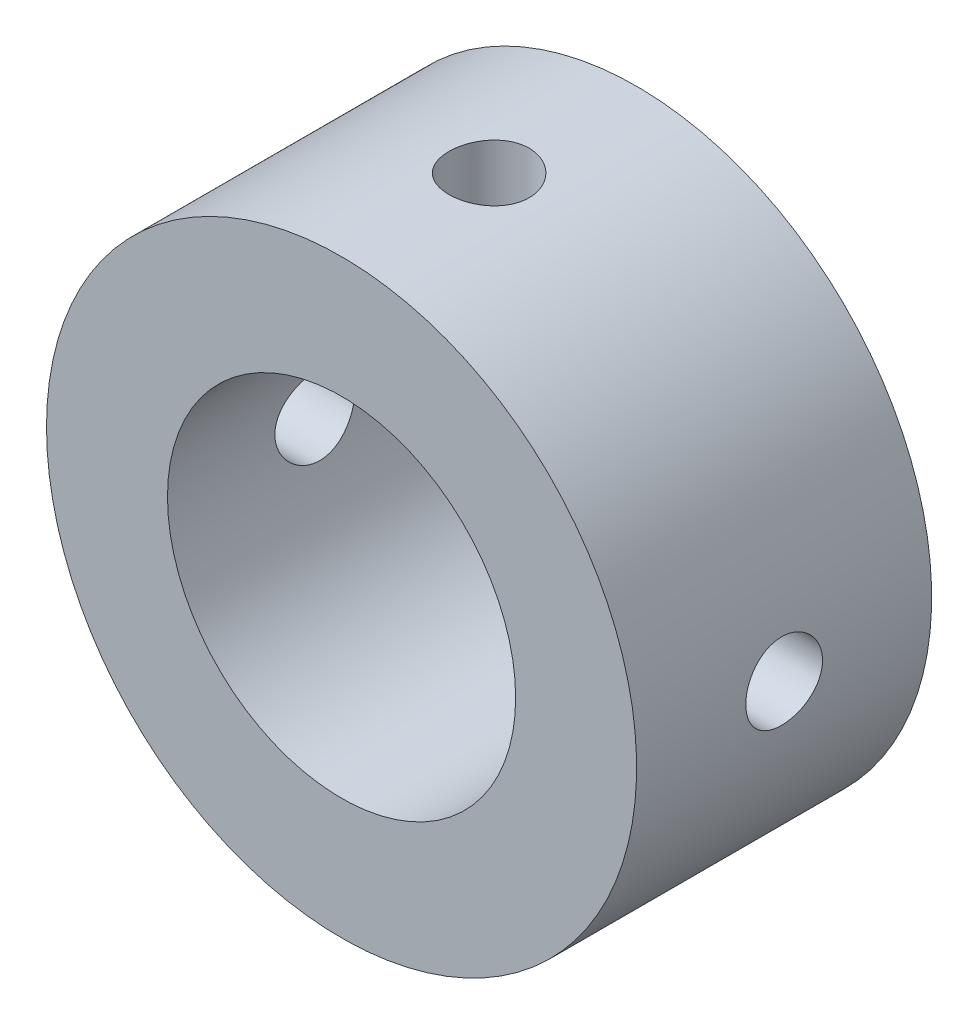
ISO-10303-21;
HEADER;
FILE_DESCRIPTION(('STEP AP214'),'2;1');
FILE_NAME('part.step','',(''),(''),'','','');
FILE_SCHEMA(('AUTOMOTIVE_DESIGN { 1 0 10303 214 1 1 1 1 }'));
ENDSEC;
DATA;
#1=APPLICATION_CONTEXT('core data for automotive mechanical design processes');
#2=APPLICATION_PROTOCOL_DEFINITION('international standard','automotive_design',2000,#1);
#3=PRODUCT_CONTEXT('',#1,'mechanical');
#4=PRODUCT('Part','Part','',(#3));
#5=PRODUCT_RELATED_PRODUCT_CATEGORY('part','',(#4));
#6=PRODUCT_DEFINITION_FORMATION('','',#4);
#7=PRODUCT_DEFINITION_CONTEXT('part definition',#1,'design');
#8=PRODUCT_DEFINITION('design','',#6,#7);
#9=PRODUCT_DEFINITION_SHAPE('','',#8);
#10=(LENGTH_UNIT() NAMED_UNIT(*) SI_UNIT(.MILLI.,.METRE.));
#11=(NAMED_UNIT(*) PLANE_ANGLE_UNIT() SI_UNIT($,.RADIAN.));
#12=(NAMED_UNIT(*) SI_UNIT($,.STERADIAN.) SOLID_ANGLE_UNIT());
#13=UNCERTAINTY_MEASURE_WITH_UNIT(LENGTH_MEASURE(1.E-05),#10,'distance_accuracy_value','');
#14=(GEOMETRIC_REPRESENTATION_CONTEXT(3) GLOBAL_UNCERTAINTY_ASSIGNED_CONTEXT((#13)) GLOBAL_UNIT_ASSIGNED_CONTEXT((#10,
#11,#12)) REPRESENTATION_CONTEXT('',''));
#15=CARTESIAN_POINT('',(0.,0.,0.));
#16=DIRECTION('',(0.,0.,1.));
#17=DIRECTION('',(1.,0.,0.));
#18=AXIS2_PLACEMENT_3D('',#15,#16,#17);
#19=CARTESIAN_POINT('',(0.,0.,12.7));
#20=DIRECTION('',(0.,0.,-1.));
#21=DIRECTION('',(-1.,0.,0.));
#22=AXIS2_PLACEMENT_3D('',#19,#20,#21);
#23=PLANE('',#22);
#24=CARTESIAN_POINT('',(0.,0.,12.7));
#25=DIRECTION('',(0.,0.,-1.));
#26=DIRECTION('',(-1.,0.,0.));
#27=AXIS2_PLACEMENT_3D('',#24,#25,#26);
#28=CIRCLE('',#27,7.493);
#29=CARTESIAN_POINT('',(-7.493,0.,12.7));
#30=VERTEX_POINT('',#29);
#31=EDGE_CURVE('E179',#30,#30,#28,.T.);
#32=ORIENTED_EDGE('',*,*,#31,.T.);
#33=EDGE_LOOP('',(#32));
#34=FACE_BOUND('',#33,.T.);
#35=CARTESIAN_POINT('',(0.,0.,12.7));
#36=DIRECTION('',(0.,0.,-1.));
#37=DIRECTION('',(-1.,0.,0.));
#38=AXIS2_PLACEMENT_3D('',#35,#36,#37);
#39=CIRCLE('',#38,12.7);
#40=CARTESIAN_POINT('',(-12.7,0.,12.7));
#41=VERTEX_POINT('',#40);
#42=EDGE_CURVE('E203',#41,#41,#39,.T.);
#43=ORIENTED_EDGE('',*,*,#42,.F.);
#44=EDGE_LOOP('',(#43));
#45=FACE_BOUND('',#44,.T.);
#46=ADVANCED_FACE('F125',(#34,#45),#23,.F.);
#47=CARTESIAN_POINT('',(0.,0.,0.));
#48=DIRECTION('',(0.,0.,-1.));
#49=DIRECTION('',(-1.,0.,0.));
#50=AXIS2_PLACEMENT_3D('',#47,#48,#49);
#51=PLANE('',#50);
#52=CARTESIAN_POINT('',(0.,0.,0.));
#53=DIRECTION('',(0.,0.,-1.));
#54=DIRECTION('',(-1.,0.,0.));
#55=AXIS2_PLACEMENT_3D('',#52,#53,#54);
#56=CIRCLE('',#55,7.493);
#57=CARTESIAN_POINT('',(-7.493,0.,0.));
#58=VERTEX_POINT('',#57);
#59=EDGE_CURVE('E180',#58,#58,#56,.T.);
#60=ORIENTED_EDGE('',*,*,#59,.F.);
#61=EDGE_LOOP('',(#60));
#62=FACE_BOUND('',#61,.T.);
#63=CARTESIAN_POINT('',(0.,0.,0.));
#64=DIRECTION('',(0.,0.,-1.));
#65=DIRECTION('',(-1.,0.,0.));
#66=AXIS2_PLACEMENT_3D('',#63,#64,#65);
#67=CIRCLE('',#66,12.7);
#68=CARTESIAN_POINT('',(-12.7,0.,0.));
#69=VERTEX_POINT('',#68);
#70=EDGE_CURVE('E205',#69,#69,#67,.T.);
#71=ORIENTED_EDGE('',*,*,#70,.T.);
#72=EDGE_LOOP('',(#71));
#73=FACE_BOUND('',#72,.T.);
#74=ADVANCED_FACE('F127',(#62,#73),#51,.T.);
#75=CARTESIAN_POINT('',(12.7,0.,6.35));
#76=DIRECTION('',(1.,0.,0.));
#77=DIRECTION('',(0.,0.,-1.));
#78=AXIS2_PLACEMENT_3D('',#75,#76,#77);
#79=CYLINDRICAL_SURFACE('',#78,1.65);
#80=CARTESIAN_POINT('',(7.493,0.,4.7));
#81=CARTESIAN_POINT('',(7.4929983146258,-0.0914977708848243,4.70000310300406));
#82=CARTESIAN_POINT('',(7.49130705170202,-0.183032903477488,4.70763645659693));
#83=CARTESIAN_POINT('',(7.48472364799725,-0.363502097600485,4.73793586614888));
#84=CARTESIAN_POINT('',(7.47982924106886,-0.452434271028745,4.76061256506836));
#85=CARTESIAN_POINT('',(7.46738437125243,-0.625063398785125,4.82025313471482));
#86=CARTESIAN_POINT('',(7.45983670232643,-0.708765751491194,4.85720198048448));
#87=CARTESIAN_POINT('',(7.44289943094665,-0.868780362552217,4.94429008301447));
#88=CARTESIAN_POINT('',(7.43350987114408,-0.945092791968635,4.99442903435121));
#89=CARTESIAN_POINT('',(7.41374640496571,-1.08940429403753,5.10733630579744));
#90=CARTESIAN_POINT('',(7.40336015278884,-1.15726608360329,5.17027794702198));
#91=CARTESIAN_POINT('',(7.38286066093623,-1.28155946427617,5.3066318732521));
#92=CARTESIAN_POINT('',(7.37274744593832,-1.33799002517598,5.38004510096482));
#93=CARTESIAN_POINT('',(7.35381724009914,-1.43842656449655,5.53627556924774));
#94=CARTESIAN_POINT('',(7.34501606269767,-1.48228606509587,5.61918906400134));
#95=CARTESIAN_POINT('',(7.32988376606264,-1.55539578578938,5.79143551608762));
#96=CARTESIAN_POINT('',(7.32355234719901,-1.58464777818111,5.88076769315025));
#97=CARTESIAN_POINT('',(7.31420221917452,-1.62725776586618,6.06182556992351));
#98=CARTESIAN_POINT('',(7.31113287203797,-1.64085899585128,6.15349135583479));
#99=CARTESIAN_POINT('',(7.30850234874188,-1.65253773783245,6.33785113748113));
#100=CARTESIAN_POINT('',(7.30894073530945,-1.65061718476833,6.43054500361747));
#101=CARTESIAN_POINT('',(7.31323031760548,-1.63150254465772,6.61251900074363));
#102=CARTESIAN_POINT('',(7.31701830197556,-1.61459133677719,6.70183056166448));
#103=CARTESIAN_POINT('',(7.32748029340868,-1.56642373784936,6.876316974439));
#104=CARTESIAN_POINT('',(7.33415446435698,-1.53516653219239,6.96149159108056));
#105=CARTESIAN_POINT('',(7.34969891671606,-1.45893531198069,7.12607991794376));
#106=CARTESIAN_POINT('',(7.35858646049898,-1.41385280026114,7.20544167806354));
#107=CARTESIAN_POINT('',(7.37754570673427,-1.31132696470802,7.35557827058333));
#108=CARTESIAN_POINT('',(7.38761757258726,-1.25388193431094,7.42635191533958));
#109=CARTESIAN_POINT('',(7.40808160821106,-1.12676572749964,7.55893157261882));
#110=CARTESIAN_POINT('',(7.41847595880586,-1.05685408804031,7.62050692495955));
#111=CARTESIAN_POINT('',(7.43821275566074,-0.907578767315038,7.731097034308));
#112=CARTESIAN_POINT('',(7.44755518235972,-0.828214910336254,7.78011155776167));
#113=CARTESIAN_POINT('',(7.46416646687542,-0.66200435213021,7.86424687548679));
#114=CARTESIAN_POINT('',(7.47143075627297,-0.575141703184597,7.89933712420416));
#115=CARTESIAN_POINT('',(7.48303336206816,-0.396557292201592,7.95435928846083));
#116=CARTESIAN_POINT('',(7.48737210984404,-0.304836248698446,7.97429343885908));
#117=CARTESIAN_POINT('',(7.49257326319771,-0.121116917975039,7.99810131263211));
#118=CARTESIAN_POINT('',(7.49350385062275,-0.0291613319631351,8.00229007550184));
#119=CARTESIAN_POINT('',(7.49197503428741,0.154135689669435,7.99534262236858));
#120=CARTESIAN_POINT('',(7.48951586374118,0.245477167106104,7.98420746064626));
#121=CARTESIAN_POINT('',(7.48152690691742,0.423907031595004,7.94718941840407));
#122=CARTESIAN_POINT('',(7.47603160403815,0.511031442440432,7.92147207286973));
#123=CARTESIAN_POINT('',(7.46258559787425,0.679729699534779,7.85620365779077));
#124=CARTESIAN_POINT('',(7.45463468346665,0.761303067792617,7.81665139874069));
#125=CARTESIAN_POINT('',(7.43699140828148,0.917884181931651,7.72418155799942));
#126=CARTESIAN_POINT('',(7.42727556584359,0.992780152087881,7.67107928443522));
#127=CARTESIAN_POINT('',(7.40722756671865,1.13271104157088,7.55325967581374));
#128=CARTESIAN_POINT('',(7.39689532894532,1.19774465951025,7.48854081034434));
#129=CARTESIAN_POINT('',(7.37654309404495,1.31735270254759,7.34787865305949));
#130=CARTESIAN_POINT('',(7.36653254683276,1.37170883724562,7.27174812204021));
#131=CARTESIAN_POINT('',(7.34817751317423,1.46686542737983,7.111254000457));
#132=CARTESIAN_POINT('',(7.33983295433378,1.50766647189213,7.02689076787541));
#133=CARTESIAN_POINT('',(7.32583505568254,1.57427735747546,6.85277975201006));
#134=CARTESIAN_POINT('',(7.32016654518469,1.60017189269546,6.76306565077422));
#135=CARTESIAN_POINT('',(7.31213566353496,1.63648195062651,6.58041853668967));
#136=CARTESIAN_POINT('',(7.30977275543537,1.64689998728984,6.48748604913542));
#137=CARTESIAN_POINT('',(7.30865477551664,1.65185320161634,6.30324197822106));
#138=CARTESIAN_POINT('',(7.30982105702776,1.64673459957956,6.2119400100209));
#139=CARTESIAN_POINT('',(7.31545200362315,1.62153465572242,6.03153389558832));
#140=CARTESIAN_POINT('',(7.31991662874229,1.60145349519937,5.94242972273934));
#141=CARTESIAN_POINT('',(7.33160261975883,1.54706675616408,5.7692280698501));
#142=CARTESIAN_POINT('',(7.33881408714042,1.51281221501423,5.68511385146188));
#143=CARTESIAN_POINT('',(7.35518496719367,1.43109467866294,5.52377508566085));
#144=CARTESIAN_POINT('',(7.36434458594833,1.38363028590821,5.44655126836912));
#145=CARTESIAN_POINT('',(7.38381417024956,1.275694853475,5.2994801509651));
#146=CARTESIAN_POINT('',(7.39414385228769,1.21497735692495,5.22981630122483));
#147=CARTESIAN_POINT('',(7.41465788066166,1.08275788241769,5.10155270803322));
#148=CARTESIAN_POINT('',(7.42484219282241,1.01125341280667,5.04295552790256));
#149=CARTESIAN_POINT('',(7.44407733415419,0.8583532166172,4.93774813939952));
#150=CARTESIAN_POINT('',(7.45311144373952,0.776839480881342,4.89130620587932));
#151=CARTESIAN_POINT('',(7.46886021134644,0.606980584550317,4.81285634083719));
#152=CARTESIAN_POINT('',(7.47557680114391,0.518641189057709,4.78083638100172));
#153=CARTESIAN_POINT('',(7.48474434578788,0.358519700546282,4.73780422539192));
#154=CARTESIAN_POINT('',(7.48782094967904,0.287599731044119,4.72365484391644));
#155=CARTESIAN_POINT('',(7.4919493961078,0.144460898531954,4.70475171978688));
#156=CARTESIAN_POINT('',(7.49300133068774,0.0722420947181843,4.69999755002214));
#157=CARTESIAN_POINT('',(7.493,0.,4.7));
#158=B_SPLINE_CURVE_WITH_KNOTS('',3,(#80,#81,#82,#83,#84,#85,#86,#87,#88,#89,#90,#91,#92,#93,
#94,#95,#96,#97,#98,#99,#100,#101,#102,#103,#104,#105,#106,#107,#108,#109,#110,#111,#112,#113,
#114,#115,#116,#117,#118,#119,#120,#121,#122,#123,#124,#125,#126,#127,#128,#129,#130,#131,#132,
#133,#134,#135,#136,#137,#138,#139,#140,#141,#142,#143,#144,#145,#146,#147,#148,#149,#150,#151,
#152,#153,#154,#155,#156,#157),.UNSPECIFIED.,.T.,.F.,(4,2,2,2,2,2,2,2,2,2,2,2,2,2,2,2,2,2,2,2,2,
2,2,2,2,2,2,2,2,2,2,2,2,2,2,2,2,2,4),(0.,0.274228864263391,0.5486519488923,0.822786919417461,
1.09691554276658,1.37503711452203,1.65318374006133,1.93445056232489,2.21568325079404,
2.49248350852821,2.7692492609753,3.04090095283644,3.31256807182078,3.5864242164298,
3.86031818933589,4.14021782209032,4.42012265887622,4.70063817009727,4.98111230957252,
5.25594379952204,5.53075638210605,5.80251005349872,6.07428709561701,6.34998734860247,
6.62572395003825,6.90661601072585,7.18749586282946,7.46676367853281,7.74598612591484,
8.01903237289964,8.29207531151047,8.56414348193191,8.83624044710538,9.11390968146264,
9.39164315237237,9.67303935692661,9.9542004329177,10.1707277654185,10.38724525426),.UNSPECIFIED.);
#159=CARTESIAN_POINT('',(7.493,0.,4.7));
#160=VERTEX_POINT('',#159);
#161=EDGE_CURVE('E158',#160,#160,#158,.T.);
#162=ORIENTED_EDGE('',*,*,#161,.T.);
#163=EDGE_LOOP('',(#162));
#164=FACE_BOUND('',#163,.T.);
#165=CARTESIAN_POINT('',(12.7,0.,8.));
#166=CARTESIAN_POINT('',(12.699998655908,0.0921793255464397,7.99999591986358));
#167=CARTESIAN_POINT('',(12.6989850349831,0.184479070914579,7.99224320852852));
#168=CARTESIAN_POINT('',(12.6950367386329,0.36657291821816,7.96142269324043));
#169=CARTESIAN_POINT('',(12.6920980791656,0.456361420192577,7.93832312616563));
#170=CARTESIAN_POINT('',(12.6846305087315,0.630674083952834,7.8775000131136));
#171=CARTESIAN_POINT('',(12.6801033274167,0.71520385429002,7.83979236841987));
#172=CARTESIAN_POINT('',(12.6699627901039,0.876696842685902,7.75085672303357));
#173=CARTESIAN_POINT('',(12.6643498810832,0.953663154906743,7.69963428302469));
#174=CARTESIAN_POINT('',(12.6526254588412,1.09835046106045,7.58478835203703));
#175=CARTESIAN_POINT('',(12.6465114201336,1.16601936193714,7.52109947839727));
#176=CARTESIAN_POINT('',(12.6344938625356,1.28974363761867,7.38326621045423));
#177=CARTESIAN_POINT('',(12.628590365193,1.34579782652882,7.30912074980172));
#178=CARTESIAN_POINT('',(12.6176384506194,1.44488859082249,7.15214851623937));
#179=CARTESIAN_POINT('',(12.612593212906,1.48787720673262,7.06929122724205));
#180=CARTESIAN_POINT('',(12.6039619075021,1.55930967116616,6.89745741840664));
#181=CARTESIAN_POINT('',(12.6003757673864,1.58775424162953,6.80848120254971));
#182=CARTESIAN_POINT('',(12.5950924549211,1.62913571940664,6.62746665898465));
#183=CARTESIAN_POINT('',(12.5933847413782,1.64215919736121,6.53544843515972));
#184=CARTESIAN_POINT('',(12.5920194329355,1.65259672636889,6.3505176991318));
#185=CARTESIAN_POINT('',(12.5923617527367,1.65001142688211,6.25760522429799));
#186=CARTESIAN_POINT('',(12.5950481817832,1.62937583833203,6.07412926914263));
#187=CARTESIAN_POINT('',(12.5973799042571,1.61142124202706,5.98355481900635));
#188=CARTESIAN_POINT('',(12.6037631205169,1.56070584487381,5.8067145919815));
#189=CARTESIAN_POINT('',(12.6078146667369,1.52794459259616,5.72044894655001));
#190=CARTESIAN_POINT('',(12.617195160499,1.44844234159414,5.55437706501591));
#191=CARTESIAN_POINT('',(12.622527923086,1.40165948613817,5.47459109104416));
#192=CARTESIAN_POINT('',(12.6338665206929,1.2954759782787,5.32397253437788));
#193=CARTESIAN_POINT('',(12.6398723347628,1.23607571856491,5.25313967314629));
#194=CARTESIAN_POINT('',(12.6519345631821,1.10582605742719,5.12188795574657));
#195=CARTESIAN_POINT('',(12.6579910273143,1.03489637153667,5.06154875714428));
#196=CARTESIAN_POINT('',(12.6694342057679,0.883835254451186,4.95359203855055));
#197=CARTESIAN_POINT('',(12.6748206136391,0.803699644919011,4.90598032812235));
#198=CARTESIAN_POINT('',(12.6843209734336,0.636417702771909,4.82483425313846));
#199=CARTESIAN_POINT('',(12.6884334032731,0.549263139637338,4.79131671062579));
#200=CARTESIAN_POINT('',(12.6949041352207,0.370614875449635,4.7394839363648));
#201=CARTESIAN_POINT('',(12.6972661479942,0.279130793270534,4.721136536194));
#202=CARTESIAN_POINT('',(12.6990820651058,0.155846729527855,4.70707852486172));
#203=CARTESIAN_POINT('',(12.6994255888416,0.124741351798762,4.7044260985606));
#204=CARTESIAN_POINT('',(12.6998847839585,0.0624285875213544,4.70088614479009));
#205=CARTESIAN_POINT('',(12.7000004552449,0.0312212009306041,4.69999861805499));
#206=CARTESIAN_POINT('',(12.699998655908,-0.0921793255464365,4.70000408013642));
#207=CARTESIAN_POINT('',(12.6989850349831,-0.184479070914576,4.70775679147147));
#208=CARTESIAN_POINT('',(12.6950367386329,-0.366572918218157,4.73857730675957));
#209=CARTESIAN_POINT('',(12.6920980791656,-0.456361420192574,4.76167687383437));
#210=CARTESIAN_POINT('',(12.6846305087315,-0.630674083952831,4.8224999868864));
#211=CARTESIAN_POINT('',(12.6801033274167,-0.715203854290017,4.86020763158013));
#212=CARTESIAN_POINT('',(12.6699627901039,-0.876696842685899,4.94914327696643));
#213=CARTESIAN_POINT('',(12.6643498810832,-0.95366315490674,5.00036571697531));
#214=CARTESIAN_POINT('',(12.6526254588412,-1.09835046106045,5.11521164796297));
#215=CARTESIAN_POINT('',(12.6465114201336,-1.16601936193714,5.17890052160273));
#216=CARTESIAN_POINT('',(12.6344938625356,-1.28974363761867,5.31673378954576));
#217=CARTESIAN_POINT('',(12.628590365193,-1.34579782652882,5.39087925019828));
#218=CARTESIAN_POINT('',(12.6176384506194,-1.44488859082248,5.54785148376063));
#219=CARTESIAN_POINT('',(12.612593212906,-1.48787720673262,5.63070877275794));
#220=CARTESIAN_POINT('',(12.6039619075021,-1.55930967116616,5.80254258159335));
#221=CARTESIAN_POINT('',(12.6003757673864,-1.58775424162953,5.89151879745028));
#222=CARTESIAN_POINT('',(12.5950924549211,-1.62913571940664,6.07253334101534));
#223=CARTESIAN_POINT('',(12.5933847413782,-1.64215919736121,6.16455156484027));
#224=CARTESIAN_POINT('',(12.5920194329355,-1.65259672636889,6.3494823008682));
#225=CARTESIAN_POINT('',(12.5923617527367,-1.65001142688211,6.442394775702));
#226=CARTESIAN_POINT('',(12.5950481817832,-1.62937583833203,6.62587073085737));
#227=CARTESIAN_POINT('',(12.5973799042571,-1.61142124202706,6.71644518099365));
#228=CARTESIAN_POINT('',(12.6037631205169,-1.56070584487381,6.8932854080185));
#229=CARTESIAN_POINT('',(12.6078146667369,-1.52794459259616,6.97955105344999));
#230=CARTESIAN_POINT('',(12.617195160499,-1.44844234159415,7.14562293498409));
#231=CARTESIAN_POINT('',(12.622527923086,-1.40165948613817,7.22540890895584));
#232=CARTESIAN_POINT('',(12.6338665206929,-1.2954759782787,7.37602746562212));
#233=CARTESIAN_POINT('',(12.6398723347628,-1.23607571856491,7.44686032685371));
#234=CARTESIAN_POINT('',(12.6519345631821,-1.10582605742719,7.57811204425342));
#235=CARTESIAN_POINT('',(12.6579910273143,-1.03489637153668,7.63845124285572));
#236=CARTESIAN_POINT('',(12.6694342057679,-0.883835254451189,7.74640796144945));
#237=CARTESIAN_POINT('',(12.6748206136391,-0.803699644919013,7.79401967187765));
#238=CARTESIAN_POINT('',(12.6843209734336,-0.636417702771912,7.87516574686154));
#239=CARTESIAN_POINT('',(12.6884334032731,-0.549263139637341,7.90868328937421));
#240=CARTESIAN_POINT('',(12.6949041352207,-0.370614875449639,7.9605160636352));
#241=CARTESIAN_POINT('',(12.6972661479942,-0.279130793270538,7.978863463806));
#242=CARTESIAN_POINT('',(12.6990820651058,-0.155846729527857,7.99292147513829));
#243=CARTESIAN_POINT('',(12.6994255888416,-0.124741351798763,7.9955739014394));
#244=CARTESIAN_POINT('',(12.6998847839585,-0.0624285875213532,7.99911385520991));
#245=CARTESIAN_POINT('',(12.7000004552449,-0.0312212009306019,8.00000138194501));
#246=CARTESIAN_POINT('',(12.7,0.,8.));
#247=B_SPLINE_CURVE_WITH_KNOTS('',3,(#165,#166,#167,#168,#169,#170,#171,#172,#173,#174,#175,
#176,#177,#178,#179,#180,#181,#182,#183,#184,#185,#186,#187,#188,#189,#190,#191,#192,#193,#194,
#195,#196,#197,#198,#199,#200,#201,#202,#203,#204,#205,#206,#207,#208,#209,#210,#211,#212,#213,
#214,#215,#216,#217,#218,#219,#220,#221,#222,#223,#224,#225,#226,#227,#228,#229,#230,#231,#232,
#233,#234,#235,#236,#237,#238,#239,#240,#241,#242,#243,#244,#245,#246),.UNSPECIFIED.,.T.,.F.,(4,
2,2,2,2,2,2,2,2,2,2,2,2,2,2,2,2,2,2,2,2,2,2,2,2,2,2,2,2,2,2,2,2,2,2,2,2,2,2,2,4),(0.,
0.276418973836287,0.553411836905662,0.830104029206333,1.10668255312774,1.38475251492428,
1.66285085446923,1.94195800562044,2.22105130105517,2.49857028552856,2.77607772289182,
3.05186979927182,3.32767028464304,3.60430242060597,3.88092594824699,4.1595654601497,
4.43833194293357,4.71743020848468,4.99593511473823,5.08955837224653,5.18318166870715,
5.45960064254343,5.73659350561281,6.01328569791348,6.28986422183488,6.56793418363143,
6.84603252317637,7.12513967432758,7.40423296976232,7.68175195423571,7.95925939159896,
8.23505146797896,8.51085195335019,8.78748408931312,9.06410761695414,9.34274712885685,
9.62151361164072,9.90061187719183,10.1791167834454,10.2727400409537,10.3663633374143),.UNSPECIFIED.);
#248=CARTESIAN_POINT('',(12.7,0.,8.));
#249=VERTEX_POINT('',#248);
#250=EDGE_CURVE('E137',#249,#249,#247,.T.);
#251=ORIENTED_EDGE('',*,*,#250,.F.);
#252=EDGE_LOOP('',(#251));
#253=FACE_BOUND('',#252,.T.);
#254=ADVANCED_FACE('F162',(#164,#253),#79,.F.);
#255=CARTESIAN_POINT('',(0.,12.7,6.35));
#256=DIRECTION('',(0.,1.,0.));
#257=DIRECTION('',(0.,0.,1.));
#258=AXIS2_PLACEMENT_3D('',#255,#256,#257);
#259=CYLINDRICAL_SURFACE('',#258,1.72719999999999);
#260=CARTESIAN_POINT('',(0.,7.493,8.07719999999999));
#261=CARTESIAN_POINT('',(-0.095662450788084,7.49299826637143,8.07719692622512));
#262=CARTESIAN_POINT('',(-0.191360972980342,7.49114954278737,8.06922567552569));
#263=CARTESIAN_POINT('',(-0.380030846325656,7.48395337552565,8.03758966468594));
#264=CARTESIAN_POINT('',(-0.473000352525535,7.47860361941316,8.01391453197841));
#265=CARTESIAN_POINT('',(-0.653459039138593,7.46499986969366,7.9516587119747));
#266=CARTESIAN_POINT('',(-0.740954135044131,7.45674907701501,7.91309444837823));
#267=CARTESIAN_POINT('',(-0.90823068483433,7.43822945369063,7.82220929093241));
#268=CARTESIAN_POINT('',(-0.988012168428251,7.42796063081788,7.7698884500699));
#269=CARTESIAN_POINT('',(-1.13901125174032,7.40632294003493,7.65199563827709));
#270=CARTESIAN_POINT('',(-1.21007275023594,7.39493919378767,7.58622644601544));
#271=CARTESIAN_POINT('',(-1.34025996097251,7.37245729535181,7.44372686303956));
#272=CARTESIAN_POINT('',(-1.39938451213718,7.36135917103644,7.36699540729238));
#273=CARTESIAN_POINT('',(-1.50472460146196,7.34055726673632,7.20357429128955));
#274=CARTESIAN_POINT('',(-1.55077090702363,7.33087249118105,7.1167729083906));
#275=CARTESIAN_POINT('',(-1.62756089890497,7.3142086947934,6.93640346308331));
#276=CARTESIAN_POINT('',(-1.65830663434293,7.30722931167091,6.84283630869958));
#277=CARTESIAN_POINT('',(-1.70310077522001,7.29691859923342,6.65329335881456));
#278=CARTESIAN_POINT('',(-1.71742715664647,7.29352661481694,6.55738662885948));
#279=CARTESIAN_POINT('',(-1.72984082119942,7.29059281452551,6.3644756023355));
#280=CARTESIAN_POINT('',(-1.72793033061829,7.29105047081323,6.26747145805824));
#281=CARTESIAN_POINT('',(-1.70814748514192,7.29570946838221,6.07720845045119));
#282=CARTESIAN_POINT('',(-1.69060100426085,7.29983437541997,5.98391354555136));
#283=CARTESIAN_POINT('',(-1.64056182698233,7.31124190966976,5.8016283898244));
#284=CARTESIAN_POINT('',(-1.60806820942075,7.31852473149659,5.71263840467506));
#285=CARTESIAN_POINT('',(-1.52876579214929,7.33550094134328,5.54058845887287));
#286=CARTESIAN_POINT('',(-1.48183425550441,7.3452148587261,5.45758718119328));
#287=CARTESIAN_POINT('',(-1.37507433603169,7.36594652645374,5.30051872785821));
#288=CARTESIAN_POINT('',(-1.31524401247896,7.37696447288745,5.22645289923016));
#289=CARTESIAN_POINT('',(-1.18267323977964,7.39938850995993,5.08748467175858));
#290=CARTESIAN_POINT('',(-1.10965642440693,7.41079755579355,5.02284610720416));
#291=CARTESIAN_POINT('',(-0.953686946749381,7.43247735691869,4.90668579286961));
#292=CARTESIAN_POINT('',(-0.870734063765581,7.44274808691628,4.85516433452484));
#293=CARTESIAN_POINT('',(-0.696905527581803,7.46103338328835,4.76662424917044));
#294=CARTESIAN_POINT('',(-0.606010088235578,7.46904209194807,4.7296431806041));
#295=CARTESIAN_POINT('',(-0.419068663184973,7.48185786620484,4.67155508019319));
#296=CARTESIAN_POINT('',(-0.323023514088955,7.48666545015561,4.65044547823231));
#297=CARTESIAN_POINT('',(-0.130769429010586,7.49246244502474,4.62509019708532));
#298=CARTESIAN_POINT('',(-0.0346103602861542,7.49353334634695,4.62048453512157));
#299=CARTESIAN_POINT('',(0.157103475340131,7.49196602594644,4.62728795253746));
#300=CARTESIAN_POINT('',(0.252658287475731,7.48932808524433,4.63869581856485));
#301=CARTESIAN_POINT('',(0.439237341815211,7.48069120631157,4.67690451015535));
#302=CARTESIAN_POINT('',(0.530302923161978,7.47473411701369,4.70351377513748));
#303=CARTESIAN_POINT('',(0.706676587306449,7.46012703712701,4.77115507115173));
#304=CARTESIAN_POINT('',(0.791984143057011,7.451476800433,4.81218842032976));
#305=CARTESIAN_POINT('',(0.955888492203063,7.43224380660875,4.90824403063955));
#306=CARTESIAN_POINT('',(1.03436007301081,7.42163304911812,4.96347421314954));
#307=CARTESIAN_POINT('',(1.18105014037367,7.39970810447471,5.08608489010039));
#308=CARTESIAN_POINT('',(1.24926713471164,7.38839381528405,5.15346714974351));
#309=CARTESIAN_POINT('',(1.37495701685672,7.36605113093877,5.30012888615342));
#310=CARTESIAN_POINT('',(1.43217935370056,7.35503344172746,5.37962503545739));
#311=CARTESIAN_POINT('',(1.53246489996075,7.33479570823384,5.5473087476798));
#312=CARTESIAN_POINT('',(1.57552873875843,7.32557558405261,5.63549592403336));
#313=CARTESIAN_POINT('',(1.64596993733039,7.31007070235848,5.81757745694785));
#314=CARTESIAN_POINT('',(1.67343841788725,7.30376893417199,5.91143504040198));
#315=CARTESIAN_POINT('',(1.71216803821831,7.29478801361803,6.10259973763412));
#316=CARTESIAN_POINT('',(1.72343210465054,7.29210820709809,6.19990622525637));
#317=CARTESIAN_POINT('',(1.72929805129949,7.29071904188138,6.39267234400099));
#318=CARTESIAN_POINT('',(1.72429825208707,7.29191476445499,6.48811938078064));
#319=CARTESIAN_POINT('',(1.69867652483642,7.29792552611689,6.67677096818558));
#320=CARTESIAN_POINT('',(1.67805482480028,7.30274051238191,6.76997555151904));
#321=CARTESIAN_POINT('',(1.62197653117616,7.31539853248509,6.95113783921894));
#322=CARTESIAN_POINT('',(1.58658399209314,7.32322848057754,7.03911634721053));
#323=CARTESIAN_POINT('',(1.50202160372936,7.34103800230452,7.20794371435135));
#324=CARTESIAN_POINT('',(1.45285014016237,7.3510178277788,7.28879173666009));
#325=CARTESIAN_POINT('',(1.34083088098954,7.37228151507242,7.44301291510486));
#326=CARTESIAN_POINT('',(1.27770187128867,7.38358954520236,7.51617851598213));
#327=CARTESIAN_POINT('',(1.14012166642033,7.4060800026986,7.65100787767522));
#328=CARTESIAN_POINT('',(1.06566783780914,7.41726240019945,7.71266895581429));
#329=CARTESIAN_POINT('',(0.906225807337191,7.43843794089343,7.82361679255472));
#330=CARTESIAN_POINT('',(0.821098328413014,7.44841109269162,7.87270745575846));
#331=CARTESIAN_POINT('',(0.643583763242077,7.46584056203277,7.95580429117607));
#332=CARTESIAN_POINT('',(0.551202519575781,7.47329888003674,7.98982245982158));
#333=CARTESIAN_POINT('',(0.38234647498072,7.48360898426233,8.03610760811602));
#334=CARTESIAN_POINT('',(0.306748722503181,7.48710796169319,8.05148648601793));
#335=CARTESIAN_POINT('',(0.154108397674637,7.49180410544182,8.07203364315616));
#336=CARTESIAN_POINT('',(0.0770659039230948,7.4930013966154,8.07720247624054));
#337=CARTESIAN_POINT('',(0.,7.493,8.07719999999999));
#338=B_SPLINE_CURVE_WITH_KNOTS('',3,(#260,#261,#262,#263,#264,#265,#266,#267,#268,#269,#270,
#271,#272,#273,#274,#275,#276,#277,#278,#279,#280,#281,#282,#283,#284,#285,#286,#287,#288,#289,
#290,#291,#292,#293,#294,#295,#296,#297,#298,#299,#300,#301,#302,#303,#304,#305,#306,#307,#308,
#309,#310,#311,#312,#313,#314,#315,#316,#317,#318,#319,#320,#321,#322,#323,#324,#325,#326,#327,
#328,#329,#330,#331,#332,#333,#334,#335,#336,#337),.UNSPECIFIED.,.T.,.F.,(4,2,2,2,2,2,2,2,2,2,2,
2,2,2,2,2,2,2,2,2,2,2,2,2,2,2,2,2,2,2,2,2,2,2,2,2,2,2,4),(0.,0.286705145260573,
0.573599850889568,0.860178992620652,1.14675703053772,1.43788561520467,1.7290425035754,
2.02381115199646,2.31854031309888,2.6082024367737,2.89782484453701,3.18154876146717,
3.46529016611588,3.75151362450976,4.03778017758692,4.33094524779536,4.62411683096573,
4.91804079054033,5.21191714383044,5.49934308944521,5.78674725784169,6.07060716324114,
6.35449301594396,6.64280034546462,6.93114958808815,7.22544464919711,7.51972662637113,
7.81227099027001,8.10476251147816,8.39014502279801,8.67552336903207,8.95967680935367,
9.2438635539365,9.53440460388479,9.82501331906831,10.1199117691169,10.4145750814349,
10.6455579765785,10.876528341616),.UNSPECIFIED.);
#339=CARTESIAN_POINT('',(0.,7.493,8.07719999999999));
#340=VERTEX_POINT('',#339);
#341=EDGE_CURVE('E141',#340,#340,#338,.T.);
#342=ORIENTED_EDGE('',*,*,#341,.T.);
#343=EDGE_LOOP('',(#342));
#344=FACE_BOUND('',#343,.T.);
#345=CARTESIAN_POINT('',(0.,12.7,4.62280000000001));
#346=CARTESIAN_POINT('',(0.096449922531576,12.6999985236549,4.6228042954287));
#347=CARTESIAN_POINT('',(0.193025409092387,12.6988888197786,4.63091267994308));
#348=CARTESIAN_POINT('',(0.383552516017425,12.6945662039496,4.66314584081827));
#349=CARTESIAN_POINT('',(0.477498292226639,12.6913489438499,4.68730373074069));
#350=CARTESIAN_POINT('',(0.6598787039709,12.6831731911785,4.75090949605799));
#351=CARTESIAN_POINT('',(0.748319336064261,12.6782166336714,4.7903403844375));
#352=CARTESIAN_POINT('',(0.917288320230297,12.6671133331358,4.88333668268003));
#353=CARTESIAN_POINT('',(0.997819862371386,12.6609670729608,4.93689636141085));
#354=CARTESIAN_POINT('',(1.149257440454,12.6481233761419,5.05701074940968));
#355=CARTESIAN_POINT('',(1.22010407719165,12.6414229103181,5.12364003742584));
#356=CARTESIAN_POINT('',(1.34965032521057,12.628249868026,5.26784492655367));
#357=CARTESIAN_POINT('',(1.40834867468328,12.6217773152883,5.34542166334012));
#358=CARTESIAN_POINT('',(1.51214859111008,12.6097643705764,5.50970023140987));
#359=CARTESIAN_POINT('',(1.55719493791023,12.6042278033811,5.59643725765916));
#360=CARTESIAN_POINT('',(1.63205883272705,12.5947535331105,5.77633263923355));
#361=CARTESIAN_POINT('',(1.66187719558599,12.5908157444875,5.86949065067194));
#362=CARTESIAN_POINT('',(1.70526016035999,12.5850136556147,6.05897467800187));
#363=CARTESIAN_POINT('',(1.71892396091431,12.5831367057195,6.15527758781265));
#364=CARTESIAN_POINT('',(1.72991702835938,12.5816302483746,6.34882654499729));
#365=CARTESIAN_POINT('',(1.72724704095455,12.5820006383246,6.44607254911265));
#366=CARTESIAN_POINT('',(1.70572964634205,12.5849354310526,6.63805092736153));
#367=CARTESIAN_POINT('',(1.68699215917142,12.5874849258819,6.73279588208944));
#368=CARTESIAN_POINT('',(1.63404310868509,12.5944674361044,6.9177850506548));
#369=CARTESIAN_POINT('',(1.59983104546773,12.5989005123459,7.00802911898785));
#370=CARTESIAN_POINT('',(1.51678613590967,12.609167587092,7.1817953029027));
#371=CARTESIAN_POINT('',(1.46790554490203,12.6150061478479,7.26529432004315));
#372=CARTESIAN_POINT('',(1.35694940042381,12.6274223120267,7.42293954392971));
#373=CARTESIAN_POINT('',(1.29487418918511,12.6339998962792,7.49708599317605));
#374=CARTESIAN_POINT('',(1.15869655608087,12.6472182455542,7.63455348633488));
#375=CARTESIAN_POINT('',(1.08450174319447,12.6538590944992,7.69778302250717));
#376=CARTESIAN_POINT('',(0.926464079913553,12.6664097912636,7.81093480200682));
#377=CARTESIAN_POINT('',(0.842616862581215,12.6723193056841,7.86085098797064));
#378=CARTESIAN_POINT('',(0.667558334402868,12.6827466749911,7.94595609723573));
#379=CARTESIAN_POINT('',(0.576337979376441,12.6872627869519,7.98112659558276));
#380=CARTESIAN_POINT('',(0.389333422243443,12.6943738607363,8.03555219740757));
#381=CARTESIAN_POINT('',(0.293559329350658,12.6969728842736,8.0548409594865));
#382=CARTESIAN_POINT('',(0.164266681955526,12.6989801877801,8.06968722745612));
#383=CARTESIAN_POINT('',(0.131481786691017,12.6993618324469,8.07250235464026));
#384=CARTESIAN_POINT('',(0.065802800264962,12.699871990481,8.07625947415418));
#385=CARTESIAN_POINT('',(0.0329087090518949,12.7000005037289,8.07720146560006));
#386=CARTESIAN_POINT('',(-0.0964499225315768,12.6999985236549,8.0771957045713));
#387=CARTESIAN_POINT('',(-0.193025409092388,12.6988888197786,8.06908732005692));
#388=CARTESIAN_POINT('',(-0.383552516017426,12.6945662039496,8.03685415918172));
#389=CARTESIAN_POINT('',(-0.47749829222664,12.6913489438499,8.01269626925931));
#390=CARTESIAN_POINT('',(-0.659878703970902,12.6831731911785,7.94909050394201));
#391=CARTESIAN_POINT('',(-0.748319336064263,12.6782166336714,7.9096596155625));
#392=CARTESIAN_POINT('',(-0.917288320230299,12.6671133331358,7.81666331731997));
#393=CARTESIAN_POINT('',(-0.997819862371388,12.6609670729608,7.76310363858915));
#394=CARTESIAN_POINT('',(-1.149257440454,12.6481233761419,7.64298925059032));
#395=CARTESIAN_POINT('',(-1.22010407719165,12.6414229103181,7.57635996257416));
#396=CARTESIAN_POINT('',(-1.34965032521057,12.628249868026,7.43215507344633));
#397=CARTESIAN_POINT('',(-1.40834867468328,12.6217773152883,7.35457833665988));
#398=CARTESIAN_POINT('',(-1.51214859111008,12.6097643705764,7.19029976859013));
#399=CARTESIAN_POINT('',(-1.55719493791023,12.6042278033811,7.10356274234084));
#400=CARTESIAN_POINT('',(-1.63205883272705,12.5947535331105,6.92366736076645));
#401=CARTESIAN_POINT('',(-1.66187719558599,12.5908157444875,6.83050934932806));
#402=CARTESIAN_POINT('',(-1.70526016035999,12.5850136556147,6.64102532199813));
#403=CARTESIAN_POINT('',(-1.71892396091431,12.5831367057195,6.54472241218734));
#404=CARTESIAN_POINT('',(-1.72991702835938,12.5816302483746,6.35117345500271));
#405=CARTESIAN_POINT('',(-1.72724704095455,12.5820006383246,6.25392745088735));
#406=CARTESIAN_POINT('',(-1.70572964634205,12.5849354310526,6.06194907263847));
#407=CARTESIAN_POINT('',(-1.68699215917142,12.5874849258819,5.96720411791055));
#408=CARTESIAN_POINT('',(-1.63404310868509,12.5944674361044,5.7822149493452));
#409=CARTESIAN_POINT('',(-1.59983104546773,12.5989005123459,5.69197088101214));
#410=CARTESIAN_POINT('',(-1.51678613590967,12.609167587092,5.5182046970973));
#411=CARTESIAN_POINT('',(-1.46790554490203,12.6150061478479,5.43470567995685));
#412=CARTESIAN_POINT('',(-1.35694940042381,12.6274223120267,5.27706045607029));
#413=CARTESIAN_POINT('',(-1.29487418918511,12.6339998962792,5.20291400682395));
#414=CARTESIAN_POINT('',(-1.15869655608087,12.6472182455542,5.06544651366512));
#415=CARTESIAN_POINT('',(-1.08450174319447,12.6538590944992,5.00221697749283));
#416=CARTESIAN_POINT('',(-0.926464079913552,12.6664097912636,4.88906519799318));
#417=CARTESIAN_POINT('',(-0.842616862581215,12.6723193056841,4.83914901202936));
#418=CARTESIAN_POINT('',(-0.667558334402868,12.6827466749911,4.75404390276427));
#419=CARTESIAN_POINT('',(-0.576337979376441,12.6872627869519,4.71887340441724));
#420=CARTESIAN_POINT('',(-0.389333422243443,12.6943738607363,4.66444780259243));
#421=CARTESIAN_POINT('',(-0.293559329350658,12.6969728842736,4.64515904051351));
#422=CARTESIAN_POINT('',(-0.164266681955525,12.6989801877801,4.63031277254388));
#423=CARTESIAN_POINT('',(-0.131481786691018,12.6993618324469,4.62749764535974));
#424=CARTESIAN_POINT('',(-0.0658028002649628,12.699871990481,4.62374052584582));
#425=CARTESIAN_POINT('',(-0.0329087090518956,12.7000005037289,4.62279853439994));
#426=CARTESIAN_POINT('',(0.,12.7,4.62280000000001));
#427=B_SPLINE_CURVE_WITH_KNOTS('',3,(#345,#346,#347,#348,#349,#350,#351,#352,#353,#354,#355,
#356,#357,#358,#359,#360,#361,#362,#363,#364,#365,#366,#367,#368,#369,#370,#371,#372,#373,#374,
#375,#376,#377,#378,#379,#380,#381,#382,#383,#384,#385,#386,#387,#388,#389,#390,#391,#392,#393,
#394,#395,#396,#397,#398,#399,#400,#401,#402,#403,#404,#405,#406,#407,#408,#409,#410,#411,#412,
#413,#414,#415,#416,#417,#418,#419,#420,#421,#422,#423,#424,#425,#426),.UNSPECIFIED.,.T.,.F.,(4,
2,2,2,2,2,2,2,2,2,2,2,2,2,2,2,2,2,2,2,2,2,2,2,2,2,2,2,2,2,2,2,2,2,2,2,2,2,2,2,4),(0.,
0.289224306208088,0.579047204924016,0.868548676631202,1.15793289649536,1.44901915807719,
1.74013563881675,2.03241438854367,2.3246774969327,2.61513645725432,2.9055821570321,
3.19405658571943,3.48254033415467,3.77197344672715,4.06139905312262,4.35314389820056,
4.64502125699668,4.93726224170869,5.22888226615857,5.32756553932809,5.42624885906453,
5.71547316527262,6.00529606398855,6.29479753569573,6.58418175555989,6.87526801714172,
7.16638449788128,7.4586632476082,7.75092635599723,8.04138531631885,8.33183101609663,
8.62030544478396,8.9087891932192,9.19822230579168,9.48764791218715,9.77939275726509,
10.0712701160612,10.3635111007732,10.6551311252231,10.7538143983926,10.8524977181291),.UNSPECIFIED.);
#428=CARTESIAN_POINT('',(0.,12.7,4.62280000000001));
#429=VERTEX_POINT('',#428);
#430=EDGE_CURVE('E173',#429,#429,#427,.T.);
#431=ORIENTED_EDGE('',*,*,#430,.F.);
#432=EDGE_LOOP('',(#431));
#433=FACE_BOUND('',#432,.T.);
#434=ADVANCED_FACE('F185',(#344,#433),#259,.F.);
#435=CARTESIAN_POINT('',(-12.7,0.,6.35));
#436=DIRECTION('',(-1.,0.,0.));
#437=DIRECTION('',(0.,0.,1.));
#438=AXIS2_PLACEMENT_3D('',#435,#436,#437);
#439=CYLINDRICAL_SURFACE('',#438,1.72719999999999);
#440=CARTESIAN_POINT('',(-7.493,0.,8.07719999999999));
#441=CARTESIAN_POINT('',(-7.49299826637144,-0.0956624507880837,8.07719692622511));
#442=CARTESIAN_POINT('',(-7.49114954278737,-0.191360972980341,8.06922567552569));
#443=CARTESIAN_POINT('',(-7.48395337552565,-0.380030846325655,8.03758966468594));
#444=CARTESIAN_POINT('',(-7.47860361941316,-0.473000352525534,8.01391453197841));
#445=CARTESIAN_POINT('',(-7.46499986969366,-0.653459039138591,7.95165871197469));
#446=CARTESIAN_POINT('',(-7.45674907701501,-0.740954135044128,7.91309444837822));
#447=CARTESIAN_POINT('',(-7.43822945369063,-0.908230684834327,7.8222092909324));
#448=CARTESIAN_POINT('',(-7.42796063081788,-0.988012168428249,7.7698884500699));
#449=CARTESIAN_POINT('',(-7.40632294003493,-1.13901125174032,7.65199563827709));
#450=CARTESIAN_POINT('',(-7.39493919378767,-1.21007275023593,7.58622644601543));
#451=CARTESIAN_POINT('',(-7.37245729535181,-1.34025996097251,7.44372686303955));
#452=CARTESIAN_POINT('',(-7.36135917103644,-1.39938451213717,7.36699540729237));
#453=CARTESIAN_POINT('',(-7.34055726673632,-1.50472460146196,7.20357429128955));
#454=CARTESIAN_POINT('',(-7.33087249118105,-1.55077090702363,7.1167729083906));
#455=CARTESIAN_POINT('',(-7.3142086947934,-1.62756089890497,6.93640346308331));
#456=CARTESIAN_POINT('',(-7.30722931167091,-1.65830663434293,6.84283630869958));
#457=CARTESIAN_POINT('',(-7.29691859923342,-1.70310077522,6.65329335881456));
#458=CARTESIAN_POINT('',(-7.29352661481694,-1.71742715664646,6.55738662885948));
#459=CARTESIAN_POINT('',(-7.29059281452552,-1.72984082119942,6.3644756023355));
#460=CARTESIAN_POINT('',(-7.29105047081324,-1.72793033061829,6.26747145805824));
#461=CARTESIAN_POINT('',(-7.29570946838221,-1.70814748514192,6.07720845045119));
#462=CARTESIAN_POINT('',(-7.29983437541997,-1.69060100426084,5.98391354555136));
#463=CARTESIAN_POINT('',(-7.31124190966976,-1.64056182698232,5.80162838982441));
#464=CARTESIAN_POINT('',(-7.3185247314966,-1.60806820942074,5.71263840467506));
#465=CARTESIAN_POINT('',(-7.33550094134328,-1.52876579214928,5.54058845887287));
#466=CARTESIAN_POINT('',(-7.3452148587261,-1.48183425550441,5.45758718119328));
#467=CARTESIAN_POINT('',(-7.36594652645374,-1.37507433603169,5.30051872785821));
#468=CARTESIAN_POINT('',(-7.37696447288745,-1.31524401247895,5.22645289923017));
#469=CARTESIAN_POINT('',(-7.39938850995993,-1.18267323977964,5.08748467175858));
#470=CARTESIAN_POINT('',(-7.41079755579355,-1.10965642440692,5.02284610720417));
#471=CARTESIAN_POINT('',(-7.43247735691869,-0.953686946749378,4.90668579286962));
#472=CARTESIAN_POINT('',(-7.44274808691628,-0.870734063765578,4.85516433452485));
#473=CARTESIAN_POINT('',(-7.46103338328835,-0.696905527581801,4.76662424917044));
#474=CARTESIAN_POINT('',(-7.46904209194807,-0.606010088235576,4.72964318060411));
#475=CARTESIAN_POINT('',(-7.48185786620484,-0.419068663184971,4.67155508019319));
#476=CARTESIAN_POINT('',(-7.48666545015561,-0.323023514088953,4.65044547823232));
#477=CARTESIAN_POINT('',(-7.49246244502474,-0.130769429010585,4.62509019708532));
#478=CARTESIAN_POINT('',(-7.49353334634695,-0.034610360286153,4.62048453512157));
#479=CARTESIAN_POINT('',(-7.49196602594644,0.157103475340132,4.62728795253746));
#480=CARTESIAN_POINT('',(-7.48932808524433,0.252658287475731,4.63869581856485));
#481=CARTESIAN_POINT('',(-7.48069120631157,0.439237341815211,4.67690451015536));
#482=CARTESIAN_POINT('',(-7.47473411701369,0.530302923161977,4.70351377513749));
#483=CARTESIAN_POINT('',(-7.46012703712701,0.706676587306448,4.77115507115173));
#484=CARTESIAN_POINT('',(-7.451476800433,0.791984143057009,4.81218842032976));
#485=CARTESIAN_POINT('',(-7.43224380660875,0.955888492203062,4.90824403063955));
#486=CARTESIAN_POINT('',(-7.42163304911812,1.03436007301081,4.96347421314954));
#487=CARTESIAN_POINT('',(-7.39970810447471,1.18105014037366,5.0860848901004));
#488=CARTESIAN_POINT('',(-7.38839381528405,1.24926713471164,5.15346714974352));
#489=CARTESIAN_POINT('',(-7.36605113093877,1.37495701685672,5.30012888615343));
#490=CARTESIAN_POINT('',(-7.35503344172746,1.43217935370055,5.3796250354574));
#491=CARTESIAN_POINT('',(-7.33479570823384,1.53246489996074,5.5473087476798));
#492=CARTESIAN_POINT('',(-7.32557558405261,1.57552873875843,5.63549592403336));
#493=CARTESIAN_POINT('',(-7.31007070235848,1.64596993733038,5.81757745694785));
#494=CARTESIAN_POINT('',(-7.30376893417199,1.67343841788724,5.91143504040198));
#495=CARTESIAN_POINT('',(-7.29478801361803,1.71216803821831,6.10259973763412));
#496=CARTESIAN_POINT('',(-7.29210820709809,1.72343210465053,6.19990622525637));
#497=CARTESIAN_POINT('',(-7.29071904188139,1.72929805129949,6.39267234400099));
#498=CARTESIAN_POINT('',(-7.29191476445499,1.72429825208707,6.48811938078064));
#499=CARTESIAN_POINT('',(-7.29792552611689,1.69867652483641,6.67677096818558));
#500=CARTESIAN_POINT('',(-7.30274051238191,1.67805482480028,6.76997555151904));
#501=CARTESIAN_POINT('',(-7.31539853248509,1.62197653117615,6.95113783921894));
#502=CARTESIAN_POINT('',(-7.32322848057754,1.58658399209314,7.03911634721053));
#503=CARTESIAN_POINT('',(-7.34103800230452,1.50202160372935,7.20794371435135));
#504=CARTESIAN_POINT('',(-7.3510178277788,1.45285014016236,7.28879173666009));
#505=CARTESIAN_POINT('',(-7.37228151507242,1.34083088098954,7.44301291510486));
#506=CARTESIAN_POINT('',(-7.38358954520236,1.27770187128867,7.51617851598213));
#507=CARTESIAN_POINT('',(-7.4060800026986,1.14012166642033,7.65100787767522));
#508=CARTESIAN_POINT('',(-7.41726240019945,1.06566783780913,7.71266895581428));
#509=CARTESIAN_POINT('',(-7.43843794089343,0.906225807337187,7.82361679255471));
#510=CARTESIAN_POINT('',(-7.44841109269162,0.821098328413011,7.87270745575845));
#511=CARTESIAN_POINT('',(-7.46584056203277,0.643583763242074,7.95580429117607));
#512=CARTESIAN_POINT('',(-7.47329888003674,0.551202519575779,7.98982245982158));
#513=CARTESIAN_POINT('',(-7.48360898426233,0.382346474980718,8.03610760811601));
#514=CARTESIAN_POINT('',(-7.48710796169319,0.306748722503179,8.05148648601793));
#515=CARTESIAN_POINT('',(-7.49180410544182,0.154108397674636,8.07203364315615));
#516=CARTESIAN_POINT('',(-7.4930013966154,0.0770659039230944,8.07720247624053));
#517=CARTESIAN_POINT('',(-7.493,0.,8.07719999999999));
#518=B_SPLINE_CURVE_WITH_KNOTS('',3,(#440,#441,#442,#443,#444,#445,#446,#447,#448,#449,#450,
#451,#452,#453,#454,#455,#456,#457,#458,#459,#460,#461,#462,#463,#464,#465,#466,#467,#468,#469,
#470,#471,#472,#473,#474,#475,#476,#477,#478,#479,#480,#481,#482,#483,#484,#485,#486,#487,#488,
#489,#490,#491,#492,#493,#494,#495,#496,#497,#498,#499,#500,#501,#502,#503,#504,#505,#506,#507,
#508,#509,#510,#511,#512,#513,#514,#515,#516,#517),.UNSPECIFIED.,.T.,.F.,(4,2,2,2,2,2,2,2,2,2,2,
2,2,2,2,2,2,2,2,2,2,2,2,2,2,2,2,2,2,2,2,2,2,2,2,2,2,2,4),(0.,0.286705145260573,
0.573599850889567,0.86017899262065,1.14675703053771,1.43788561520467,1.72904250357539,
2.02381115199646,2.31854031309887,2.60820243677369,2.89782484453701,3.18154876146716,
3.46529016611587,3.75151362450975,4.03778017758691,4.33094524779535,4.62411683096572,
4.91804079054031,5.21191714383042,5.4993430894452,5.78674725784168,6.07060716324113,
6.35449301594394,6.6428003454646,6.93114958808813,7.22544464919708,7.51972662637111,
7.81227099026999,8.10476251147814,8.39014502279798,8.67552336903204,8.95967680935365,
9.24386355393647,9.53440460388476,9.82501331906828,10.1199117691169,10.4145750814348,
10.6455579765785,10.876528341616),.UNSPECIFIED.);
#519=CARTESIAN_POINT('',(-7.493,0.,8.07719999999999));
#520=VERTEX_POINT('',#519);
#521=EDGE_CURVE('E146',#520,#520,#518,.T.);
#522=ORIENTED_EDGE('',*,*,#521,.T.);
#523=EDGE_LOOP('',(#522));
#524=FACE_BOUND('',#523,.T.);
#525=CARTESIAN_POINT('',(-12.7,0.,8.07719999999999));
#526=CARTESIAN_POINT('',(-12.6999985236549,-0.0964499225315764,8.0771957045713));
#527=CARTESIAN_POINT('',(-12.6988888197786,-0.193025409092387,8.06908732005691));
#528=CARTESIAN_POINT('',(-12.6945662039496,-0.383552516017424,8.03685415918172));
#529=CARTESIAN_POINT('',(-12.6913489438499,-0.477498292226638,8.01269626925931));
#530=CARTESIAN_POINT('',(-12.6831731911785,-0.659878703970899,7.94909050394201));
#531=CARTESIAN_POINT('',(-12.6782166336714,-0.74831933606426,7.90965961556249));
#532=CARTESIAN_POINT('',(-12.6671133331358,-0.917288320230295,7.81666331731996));
#533=CARTESIAN_POINT('',(-12.6609670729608,-0.997819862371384,7.76310363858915));
#534=CARTESIAN_POINT('',(-12.6481233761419,-1.149257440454,7.64298925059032));
#535=CARTESIAN_POINT('',(-12.6414229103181,-1.22010407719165,7.57635996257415));
#536=CARTESIAN_POINT('',(-12.628249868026,-1.34965032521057,7.43215507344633));
#537=CARTESIAN_POINT('',(-12.6217773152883,-1.40834867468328,7.35457833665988));
#538=CARTESIAN_POINT('',(-12.6097643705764,-1.51214859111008,7.19029976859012));
#539=CARTESIAN_POINT('',(-12.6042278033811,-1.55719493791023,7.10356274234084));
#540=CARTESIAN_POINT('',(-12.5947535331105,-1.63205883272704,6.92366736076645));
#541=CARTESIAN_POINT('',(-12.5908157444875,-1.66187719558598,6.83050934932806));
#542=CARTESIAN_POINT('',(-12.5850136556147,-1.70526016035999,6.64102532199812));
#543=CARTESIAN_POINT('',(-12.5831367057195,-1.71892396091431,6.54472241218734));
#544=CARTESIAN_POINT('',(-12.5816302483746,-1.72991702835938,6.35117345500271));
#545=CARTESIAN_POINT('',(-12.5820006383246,-1.72724704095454,6.25392745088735));
#546=CARTESIAN_POINT('',(-12.5849354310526,-1.70572964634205,6.06194907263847));
#547=CARTESIAN_POINT('',(-12.5874849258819,-1.68699215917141,5.96720411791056));
#548=CARTESIAN_POINT('',(-12.5944674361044,-1.63404310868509,5.7822149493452));
#549=CARTESIAN_POINT('',(-12.5989005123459,-1.59983104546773,5.69197088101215));
#550=CARTESIAN_POINT('',(-12.609167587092,-1.51678613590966,5.51820469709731));
#551=CARTESIAN_POINT('',(-12.6150061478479,-1.46790554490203,5.43470567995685));
#552=CARTESIAN_POINT('',(-12.6274223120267,-1.3569494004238,5.27706045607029));
#553=CARTESIAN_POINT('',(-12.6339998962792,-1.2948741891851,5.20291400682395));
#554=CARTESIAN_POINT('',(-12.6472182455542,-1.15869655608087,5.06544651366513));
#555=CARTESIAN_POINT('',(-12.6538590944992,-1.08450174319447,5.00221697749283));
#556=CARTESIAN_POINT('',(-12.6664097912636,-0.926464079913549,4.88906519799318));
#557=CARTESIAN_POINT('',(-12.6723193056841,-0.842616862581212,4.83914901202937));
#558=CARTESIAN_POINT('',(-12.6827466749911,-0.667558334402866,4.75404390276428));
#559=CARTESIAN_POINT('',(-12.6872627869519,-0.576337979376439,4.71887340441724));
#560=CARTESIAN_POINT('',(-12.6943738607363,-0.389333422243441,4.66444780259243));
#561=CARTESIAN_POINT('',(-12.6969728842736,-0.293559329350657,4.64515904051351));
#562=CARTESIAN_POINT('',(-12.6989801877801,-0.164266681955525,4.63031277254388));
#563=CARTESIAN_POINT('',(-12.6993618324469,-0.131481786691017,4.62749764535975));
#564=CARTESIAN_POINT('',(-12.699871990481,-0.065802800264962,4.62374052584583));
#565=CARTESIAN_POINT('',(-12.7000005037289,-0.0329087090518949,4.62279853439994));
#566=CARTESIAN_POINT('',(-12.6999985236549,0.0964499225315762,4.6228042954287));
#567=CARTESIAN_POINT('',(-12.6988888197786,0.193025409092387,4.63091267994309));
#568=CARTESIAN_POINT('',(-12.6945662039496,0.383552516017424,4.66314584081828));
#569=CARTESIAN_POINT('',(-12.6913489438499,0.477498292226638,4.68730373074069));
#570=CARTESIAN_POINT('',(-12.6831731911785,0.659878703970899,4.75090949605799));
#571=CARTESIAN_POINT('',(-12.6782166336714,0.74831933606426,4.79034038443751));
#572=CARTESIAN_POINT('',(-12.6671133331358,0.917288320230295,4.88333668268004));
#573=CARTESIAN_POINT('',(-12.6609670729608,0.997819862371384,4.93689636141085));
#574=CARTESIAN_POINT('',(-12.6481233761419,1.149257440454,5.05701074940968));
#575=CARTESIAN_POINT('',(-12.6414229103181,1.22010407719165,5.12364003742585));
#576=CARTESIAN_POINT('',(-12.628249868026,1.34965032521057,5.26784492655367));
#577=CARTESIAN_POINT('',(-12.6217773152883,1.40834867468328,5.34542166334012));
#578=CARTESIAN_POINT('',(-12.6097643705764,1.51214859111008,5.50970023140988));
#579=CARTESIAN_POINT('',(-12.6042278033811,1.55719493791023,5.59643725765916));
#580=CARTESIAN_POINT('',(-12.5947535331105,1.63205883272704,5.77633263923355));
#581=CARTESIAN_POINT('',(-12.5908157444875,1.66187719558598,5.86949065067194));
#582=CARTESIAN_POINT('',(-12.5850136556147,1.70526016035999,6.05897467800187));
#583=CARTESIAN_POINT('',(-12.5831367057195,1.71892396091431,6.15527758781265));
#584=CARTESIAN_POINT('',(-12.5816302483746,1.72991702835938,6.34882654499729));
#585=CARTESIAN_POINT('',(-12.5820006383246,1.72724704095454,6.44607254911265));
#586=CARTESIAN_POINT('',(-12.5849354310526,1.70572964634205,6.63805092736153));
#587=CARTESIAN_POINT('',(-12.5874849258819,1.68699215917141,6.73279588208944));
#588=CARTESIAN_POINT('',(-12.5944674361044,1.63404310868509,6.9177850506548));
#589=CARTESIAN_POINT('',(-12.5989005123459,1.59983104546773,7.00802911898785));
#590=CARTESIAN_POINT('',(-12.609167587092,1.51678613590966,7.18179530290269));
#591=CARTESIAN_POINT('',(-12.6150061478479,1.46790554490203,7.26529432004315));
#592=CARTESIAN_POINT('',(-12.6274223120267,1.3569494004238,7.42293954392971));
#593=CARTESIAN_POINT('',(-12.6339998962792,1.2948741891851,7.49708599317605));
#594=CARTESIAN_POINT('',(-12.6472182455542,1.15869655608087,7.63455348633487));
#595=CARTESIAN_POINT('',(-12.6538590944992,1.08450174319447,7.69778302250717));
#596=CARTESIAN_POINT('',(-12.6664097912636,0.926464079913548,7.81093480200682));
#597=CARTESIAN_POINT('',(-12.6723193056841,0.842616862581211,7.86085098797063));
#598=CARTESIAN_POINT('',(-12.6827466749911,0.667558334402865,7.94595609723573));
#599=CARTESIAN_POINT('',(-12.6872627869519,0.576337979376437,7.98112659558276));
#600=CARTESIAN_POINT('',(-12.6943738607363,0.389333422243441,8.03555219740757));
#601=CARTESIAN_POINT('',(-12.6969728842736,0.293559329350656,8.05484095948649));
#602=CARTESIAN_POINT('',(-12.6989801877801,0.164266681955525,8.06968722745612));
#603=CARTESIAN_POINT('',(-12.6993618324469,0.131481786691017,8.07250235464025));
#604=CARTESIAN_POINT('',(-12.699871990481,0.0658028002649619,8.07625947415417));
#605=CARTESIAN_POINT('',(-12.7000005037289,0.0329087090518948,8.07720146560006));
#606=CARTESIAN_POINT('',(-12.7,0.,8.07719999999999));
#607=B_SPLINE_CURVE_WITH_KNOTS('',3,(#525,#526,#527,#528,#529,#530,#531,#532,#533,#534,#535,
#536,#537,#538,#539,#540,#541,#542,#543,#544,#545,#546,#547,#548,#549,#550,#551,#552,#553,#554,
#555,#556,#557,#558,#559,#560,#561,#562,#563,#564,#565,#566,#567,#568,#569,#570,#571,#572,#573,
#574,#575,#576,#577,#578,#579,#580,#581,#582,#583,#584,#585,#586,#587,#588,#589,#590,#591,#592,
#593,#594,#595,#596,#597,#598,#599,#600,#601,#602,#603,#604,#605,#606),.UNSPECIFIED.,.T.,.F.,(4,
2,2,2,2,2,2,2,2,2,2,2,2,2,2,2,2,2,2,2,2,2,2,2,2,2,2,2,2,2,2,2,2,2,2,2,2,2,2,2,4),(0.,
0.289224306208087,0.579047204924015,0.868548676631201,1.15793289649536,1.44901915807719,
1.74013563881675,2.03241438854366,2.32467749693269,2.61513645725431,2.90558215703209,
3.19405658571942,3.48254033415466,3.77197344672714,4.06139905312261,4.35314389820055,
4.64502125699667,4.93726224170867,5.22888226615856,5.32756553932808,5.42624885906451,
5.7154731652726,6.00529606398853,6.29479753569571,6.58418175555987,6.8752680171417,
7.16638449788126,7.45866324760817,7.75092635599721,8.04138531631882,8.3318310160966,
8.62030544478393,8.90878919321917,9.19822230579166,9.48764791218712,9.77939275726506,
10.0712701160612,10.3635111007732,10.6551311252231,10.7538143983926,10.852497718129),.UNSPECIFIED.);
#608=CARTESIAN_POINT('',(-12.7,0.,8.07719999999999));
#609=VERTEX_POINT('',#608);
#610=EDGE_CURVE('E11',#609,#609,#607,.T.);
#611=ORIENTED_EDGE('',*,*,#610,.F.);
#612=EDGE_LOOP('',(#611));
#613=FACE_BOUND('',#612,.T.);
#614=ADVANCED_FACE('F188',(#524,#613),#439,.F.);
#615=CARTESIAN_POINT('',(0.,0.,12.7));
#616=DIRECTION('',(0.,0.,-1.));
#617=DIRECTION('',(-1.,0.,0.));
#618=AXIS2_PLACEMENT_3D('',#615,#616,#617);
#619=CYLINDRICAL_SURFACE('',#618,7.493);
#620=ORIENTED_EDGE('',*,*,#521,.F.);
#621=EDGE_LOOP('',(#620));
#622=FACE_BOUND('',#621,.T.);
#623=ORIENTED_EDGE('',*,*,#59,.T.);
#624=EDGE_LOOP('',(#623));
#625=FACE_BOUND('',#624,.T.);
#626=ORIENTED_EDGE('',*,*,#31,.F.);
#627=EDGE_LOOP('',(#626));
#628=FACE_BOUND('',#627,.T.);
#629=ORIENTED_EDGE('',*,*,#161,.F.);
#630=EDGE_LOOP('',(#629));
#631=FACE_BOUND('',#630,.T.);
#632=ORIENTED_EDGE('',*,*,#341,.F.);
#633=EDGE_LOOP('',(#632));
#634=FACE_BOUND('',#633,.T.);
#635=ADVANCED_FACE('F167',(#622,#625,#628,#631,#634),#619,.F.);
#636=CARTESIAN_POINT('',(0.,0.,12.7));
#637=DIRECTION('',(0.,0.,-1.));
#638=DIRECTION('',(-1.,0.,0.));
#639=AXIS2_PLACEMENT_3D('',#636,#637,#638);
#640=CYLINDRICAL_SURFACE('',#639,12.7);
#641=ORIENTED_EDGE('',*,*,#70,.F.);
#642=EDGE_LOOP('',(#641));
#643=FACE_BOUND('',#642,.T.);
#644=ORIENTED_EDGE('',*,*,#42,.T.);
#645=EDGE_LOOP('',(#644));
#646=FACE_BOUND('',#645,.T.);
#647=ORIENTED_EDGE('',*,*,#250,.T.);
#648=EDGE_LOOP('',(#647));
#649=FACE_BOUND('',#648,.T.);
#650=ORIENTED_EDGE('',*,*,#430,.T.);
#651=EDGE_LOOP('',(#650));
#652=FACE_BOUND('',#651,.T.);
#653=ORIENTED_EDGE('',*,*,#610,.T.);
#654=EDGE_LOOP('',(#653));
#655=FACE_BOUND('',#654,.T.);
#656=ADVANCED_FACE('F164',(#643,#646,#649,#652,#655),#640,.T.);
#657=CLOSED_SHELL('',(#46,#74,#254,#434,#614,#635,#656));
#658=MANIFOLD_SOLID_BREP('B2',#657);
#659=ADVANCED_BREP_SHAPE_REPRESENTATION('',(#18,#658),#14);
#660=SHAPE_DEFINITION_REPRESENTATION(#9,#659);
ENDSEC;
END-ISO-10303-21;
